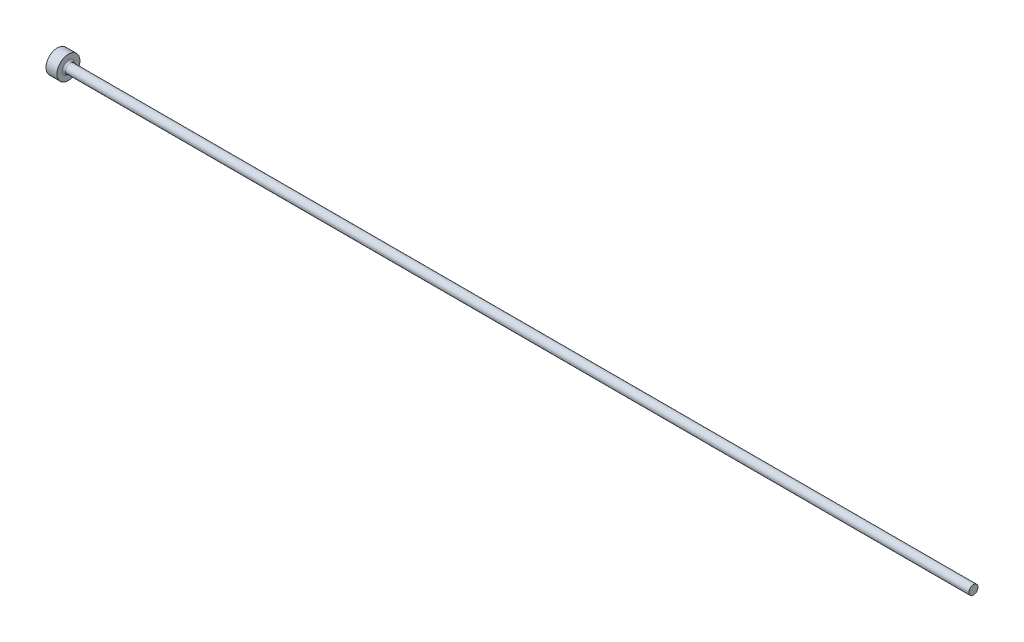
ISO-10303-21;
HEADER;
FILE_DESCRIPTION(('STEP AP214'),'2;1');
FILE_NAME('part.step','',(''),(''),'','','');
FILE_SCHEMA(('AUTOMOTIVE_DESIGN { 1 0 10303 214 1 1 1 1 }'));
ENDSEC;
DATA;
#1=APPLICATION_CONTEXT('core data for automotive mechanical design processes');
#2=APPLICATION_PROTOCOL_DEFINITION('international standard','automotive_design',2000,#1);
#3=PRODUCT_CONTEXT('',#1,'mechanical');
#4=PRODUCT('Part','Part','',(#3));
#5=PRODUCT_RELATED_PRODUCT_CATEGORY('part','',(#4));
#6=PRODUCT_DEFINITION_FORMATION('','',#4);
#7=PRODUCT_DEFINITION_CONTEXT('part definition',#1,'design');
#8=PRODUCT_DEFINITION('design','',#6,#7);
#9=PRODUCT_DEFINITION_SHAPE('','',#8);
#10=(LENGTH_UNIT() NAMED_UNIT(*) SI_UNIT(.MILLI.,.METRE.));
#11=(NAMED_UNIT(*) PLANE_ANGLE_UNIT() SI_UNIT($,.RADIAN.));
#12=(NAMED_UNIT(*) SI_UNIT($,.STERADIAN.) SOLID_ANGLE_UNIT());
#13=UNCERTAINTY_MEASURE_WITH_UNIT(LENGTH_MEASURE(1.E-05),#10,'distance_accuracy_value','');
#14=(GEOMETRIC_REPRESENTATION_CONTEXT(3) GLOBAL_UNCERTAINTY_ASSIGNED_CONTEXT((#13)) GLOBAL_UNIT_ASSIGNED_CONTEXT((#10,
#11,#12)) REPRESENTATION_CONTEXT('',''));
#15=CARTESIAN_POINT('',(0.,0.,0.));
#16=DIRECTION('',(0.,0.,1.));
#17=DIRECTION('',(1.,0.,0.));
#18=AXIS2_PLACEMENT_3D('',#15,#16,#17);
#19=CARTESIAN_POINT('',(0.,0.,0.));
#20=DIRECTION('',(-1.,0.,0.));
#21=DIRECTION('',(0.,-1.,0.));
#22=AXIS2_PLACEMENT_3D('',#19,#20,#21);
#23=PLANE('',#22);
#24=CARTESIAN_POINT('',(0.,0.,0.));
#25=DIRECTION('',(1.,0.,0.));
#26=DIRECTION('',(0.,1.,0.));
#27=AXIS2_PLACEMENT_3D('',#24,#25,#26);
#28=CIRCLE('',#27,1.25);
#29=CARTESIAN_POINT('',(0.,1.25,0.));
#30=VERTEX_POINT('',#29);
#31=EDGE_CURVE('E25',#30,#30,#28,.T.);
#32=ORIENTED_EDGE('',*,*,#31,.F.);
#33=EDGE_LOOP('',(#32));
#34=FACE_BOUND('',#33,.T.);
#35=ADVANCED_FACE('F14',(#34),#23,.T.);
#36=CARTESIAN_POINT('',(100.,0.,0.));
#37=DIRECTION('',(1.,0.,0.));
#38=DIRECTION('',(0.,1.,0.));
#39=AXIS2_PLACEMENT_3D('',#36,#37,#38);
#40=CYLINDRICAL_SURFACE('',#39,1.25);
#41=ORIENTED_EDGE('',*,*,#31,.T.);
#42=EDGE_LOOP('',(#41));
#43=FACE_BOUND('',#42,.T.);
#44=CARTESIAN_POINT('',(1.2,0.,0.));
#45=DIRECTION('',(1.,0.,0.));
#46=DIRECTION('',(0.,1.,0.));
#47=AXIS2_PLACEMENT_3D('',#44,#45,#46);
#48=CIRCLE('',#47,1.25);
#49=CARTESIAN_POINT('',(1.2,1.25,0.));
#50=VERTEX_POINT('',#49);
#51=EDGE_CURVE('E29',#50,#50,#48,.T.);
#52=ORIENTED_EDGE('',*,*,#51,.F.);
#53=EDGE_LOOP('',(#52));
#54=FACE_BOUND('',#53,.T.);
#55=ADVANCED_FACE('F51',(#43,#54),#40,.T.);
#56=CARTESIAN_POINT('',(1.2,1.25,0.));
#57=DIRECTION('',(1.,0.,0.));
#58=DIRECTION('',(0.,1.,0.));
#59=AXIS2_PLACEMENT_3D('',#56,#57,#58);
#60=PLANE('',#59);
#61=CARTESIAN_POINT('',(1.2,0.,0.));
#62=DIRECTION('',(1.,0.,0.));
#63=DIRECTION('',(0.,1.,0.));
#64=AXIS2_PLACEMENT_3D('',#61,#62,#63);
#65=CIRCLE('',#64,0.699999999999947);
#66=CARTESIAN_POINT('',(1.2,0.699999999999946,0.));
#67=VERTEX_POINT('',#66);
#68=EDGE_CURVE('E9',#67,#67,#65,.F.);
#69=ORIENTED_EDGE('',*,*,#68,.T.);
#70=EDGE_LOOP('',(#69));
#71=FACE_BOUND('',#70,.T.);
#72=ORIENTED_EDGE('',*,*,#51,.T.);
#73=EDGE_LOOP('',(#72));
#74=FACE_BOUND('',#73,.T.);
#75=ADVANCED_FACE('F42',(#71,#74),#60,.T.);
#76=CARTESIAN_POINT('',(100.,0.,0.));
#77=DIRECTION('',(1.,0.,0.));
#78=DIRECTION('',(0.,1.,0.));
#79=AXIS2_PLACEMENT_3D('',#76,#77,#78);
#80=CYLINDRICAL_SURFACE('',#79,0.499999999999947);
#81=CARTESIAN_POINT('',(1.4,0.,0.));
#82=DIRECTION('',(1.,0.,0.));
#83=DIRECTION('',(0.,1.,0.));
#84=AXIS2_PLACEMENT_3D('',#81,#82,#83);
#85=CIRCLE('',#84,0.499999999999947);
#86=CARTESIAN_POINT('',(1.4,0.499999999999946,0.));
#87=VERTEX_POINT('',#86);
#88=EDGE_CURVE('E21',#87,#87,#85,.T.);
#89=ORIENTED_EDGE('',*,*,#88,.T.);
#90=EDGE_LOOP('',(#89));
#91=FACE_BOUND('',#90,.T.);
#92=CARTESIAN_POINT('',(100.,0.,0.));
#93=DIRECTION('',(1.,0.,0.));
#94=DIRECTION('',(0.,1.,0.));
#95=AXIS2_PLACEMENT_3D('',#92,#93,#94);
#96=CIRCLE('',#95,0.499999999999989);
#97=CARTESIAN_POINT('',(100.,0.499999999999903,0.));
#98=VERTEX_POINT('',#97);
#99=EDGE_CURVE('E34',#98,#98,#96,.T.);
#100=ORIENTED_EDGE('',*,*,#99,.F.);
#101=EDGE_LOOP('',(#100));
#102=FACE_BOUND('',#101,.T.);
#103=ADVANCED_FACE('F40',(#91,#102),#80,.T.);
#104=CARTESIAN_POINT('',(100.,0.499999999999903,0.));
#105=DIRECTION('',(1.,0.,0.));
#106=DIRECTION('',(0.,1.,0.));
#107=AXIS2_PLACEMENT_3D('',#104,#105,#106);
#108=PLANE('',#107);
#109=ORIENTED_EDGE('',*,*,#99,.T.);
#110=EDGE_LOOP('',(#109));
#111=FACE_BOUND('',#110,.T.);
#112=ADVANCED_FACE('F38',(#111),#108,.T.);
#113=CARTESIAN_POINT('',(1.4,0.,0.));
#114=DIRECTION('',(1.,0.,0.));
#115=DIRECTION('',(0.,1.,0.));
#116=AXIS2_PLACEMENT_3D('',#113,#114,#115);
#117=TOROIDAL_SURFACE('',#116,0.699999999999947,0.2);
#118=ORIENTED_EDGE('',*,*,#68,.F.);
#119=EDGE_LOOP('',(#118));
#120=FACE_BOUND('',#119,.T.);
#121=ORIENTED_EDGE('',*,*,#88,.F.);
#122=EDGE_LOOP('',(#121));
#123=FACE_BOUND('',#122,.T.);
#124=ADVANCED_FACE('F16',(#120,#123),#117,.F.);
#125=CLOSED_SHELL('',(#35,#55,#75,#103,#112,#124));
#126=MANIFOLD_SOLID_BREP('B1',#125);
#127=ADVANCED_BREP_SHAPE_REPRESENTATION('',(#18,#126),#14);
#128=SHAPE_DEFINITION_REPRESENTATION(#9,#127);
ENDSEC;
END-ISO-10303-21;
